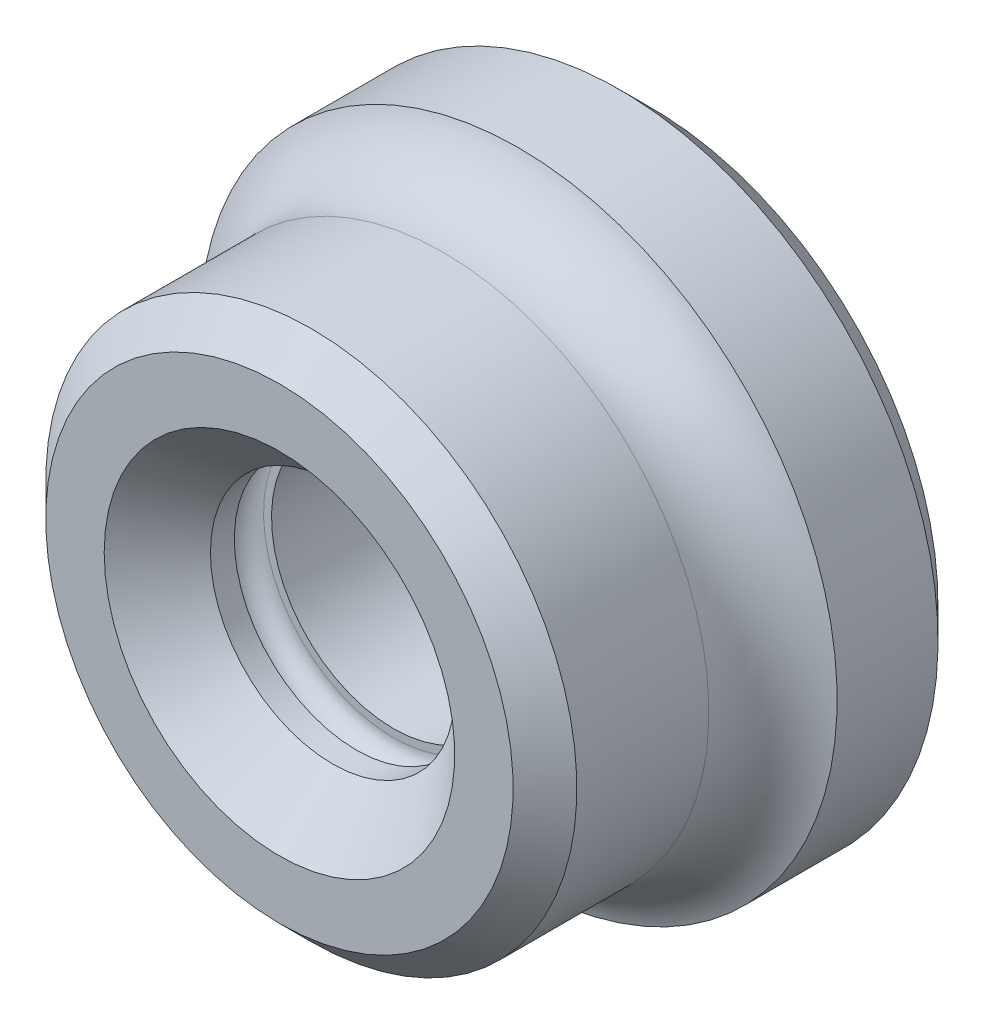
ISO-10303-21;
HEADER;
FILE_DESCRIPTION(('STEP AP214'),'2;1');
FILE_NAME('part.step','',(''),(''),'','','');
FILE_SCHEMA(('AUTOMOTIVE_DESIGN { 1 0 10303 214 1 1 1 1 }'));
ENDSEC;
DATA;
#1=APPLICATION_CONTEXT('core data for automotive mechanical design processes');
#2=APPLICATION_PROTOCOL_DEFINITION('international standard','automotive_design',2000,#1);
#3=PRODUCT_CONTEXT('',#1,'mechanical');
#4=PRODUCT('Part','Part','',(#3));
#5=PRODUCT_RELATED_PRODUCT_CATEGORY('part','',(#4));
#6=PRODUCT_DEFINITION_FORMATION('','',#4);
#7=PRODUCT_DEFINITION_CONTEXT('part definition',#1,'design');
#8=PRODUCT_DEFINITION('design','',#6,#7);
#9=PRODUCT_DEFINITION_SHAPE('','',#8);
#10=(LENGTH_UNIT() NAMED_UNIT(*) SI_UNIT(.MILLI.,.METRE.));
#11=(NAMED_UNIT(*) PLANE_ANGLE_UNIT() SI_UNIT($,.RADIAN.));
#12=(NAMED_UNIT(*) SI_UNIT($,.STERADIAN.) SOLID_ANGLE_UNIT());
#13=UNCERTAINTY_MEASURE_WITH_UNIT(LENGTH_MEASURE(1.E-05),#10,'distance_accuracy_value','');
#14=(GEOMETRIC_REPRESENTATION_CONTEXT(3) GLOBAL_UNCERTAINTY_ASSIGNED_CONTEXT((#13)) GLOBAL_UNIT_ASSIGNED_CONTEXT((#10,
#11,#12)) REPRESENTATION_CONTEXT('',''));
#15=CARTESIAN_POINT('',(0.,0.,0.));
#16=DIRECTION('',(0.,0.,1.));
#17=DIRECTION('',(1.,0.,0.));
#18=AXIS2_PLACEMENT_3D('',#15,#16,#17);
#19=CARTESIAN_POINT('',(0.,0.,2.99999999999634));
#20=DIRECTION('',(0.,0.,1.));
#21=DIRECTION('',(0.,-1.,0.));
#22=AXIS2_PLACEMENT_3D('',#19,#20,#21);
#23=CONICAL_SURFACE('',#22,2.30000000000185,1.0297442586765);
#24=CARTESIAN_POINT('',(0.,2.22044604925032E-13,1.61802057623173));
#25=VERTEX_POINT('',#24);
#26=VERTEX_LOOP('',#25);
#27=FACE_BOUND('',#26,.T.);
#28=CARTESIAN_POINT('',(0.,0.,3.));
#29=DIRECTION('',(0.,0.,1.));
#30=DIRECTION('',(0.,-1.,0.));
#31=AXIS2_PLACEMENT_3D('',#28,#29,#30);
#32=CIRCLE('',#31,2.3);
#33=CARTESIAN_POINT('',(0.,-2.3,3.));
#34=VERTEX_POINT('',#33);
#35=EDGE_CURVE('E30',#34,#34,#32,.T.);
#36=ORIENTED_EDGE('',*,*,#35,.T.);
#37=EDGE_LOOP('',(#36));
#38=FACE_BOUND('',#37,.T.);
#39=ADVANCED_FACE('F14',(#27,#38),#23,.F.);
#40=CARTESIAN_POINT('',(0.,0.,0.));
#41=DIRECTION('',(0.,0.,1.));
#42=DIRECTION('',(0.,-1.,0.));
#43=AXIS2_PLACEMENT_3D('',#40,#41,#42);
#44=CYLINDRICAL_SURFACE('',#43,2.3);
#45=ORIENTED_EDGE('',*,*,#35,.F.);
#46=EDGE_LOOP('',(#45));
#47=FACE_BOUND('',#46,.T.);
#48=CARTESIAN_POINT('',(0.,0.,4.85));
#49=DIRECTION('',(0.,0.,1.));
#50=DIRECTION('',(0.,-1.,0.));
#51=AXIS2_PLACEMENT_3D('',#48,#49,#50);
#52=CIRCLE('',#51,2.3);
#53=CARTESIAN_POINT('',(0.,-2.3,4.85));
#54=VERTEX_POINT('',#53);
#55=EDGE_CURVE('E17',#54,#54,#52,.T.);
#56=ORIENTED_EDGE('',*,*,#55,.T.);
#57=EDGE_LOOP('',(#56));
#58=FACE_BOUND('',#57,.T.);
#59=ADVANCED_FACE('F27',(#47,#58),#44,.F.);
#60=CARTESIAN_POINT('',(2.3,0.,4.85));
#61=DIRECTION('',(0.,0.,-1.));
#62=DIRECTION('',(0.,1.,0.));
#63=AXIS2_PLACEMENT_3D('',#60,#61,#62);
#64=PLANE('',#63);
#65=ORIENTED_EDGE('',*,*,#55,.F.);
#66=EDGE_LOOP('',(#65));
#67=FACE_BOUND('',#66,.T.);
#68=CARTESIAN_POINT('',(0.,0.,4.85));
#69=DIRECTION('',(0.,0.,-1.));
#70=DIRECTION('',(0.,1.,0.));
#71=AXIS2_PLACEMENT_3D('',#68,#69,#70);
#72=CIRCLE('',#71,2.45);
#73=CARTESIAN_POINT('',(0.,2.45,4.85));
#74=VERTEX_POINT('',#73);
#75=EDGE_CURVE('E34',#74,#74,#72,.F.);
#76=ORIENTED_EDGE('',*,*,#75,.T.);
#77=EDGE_LOOP('',(#76));
#78=FACE_BOUND('',#77,.T.);
#79=ADVANCED_FACE('F70',(#67,#78),#64,.F.);
#80=CARTESIAN_POINT('',(0.,0.,0.5));
#81=DIRECTION('',(0.,0.,-1.));
#82=DIRECTION('',(0.,1.,0.));
#83=AXIS2_PLACEMENT_3D('',#80,#81,#82);
#84=PLANE('',#83);
#85=CARTESIAN_POINT('',(0.,0.,0.5));
#86=DIRECTION('',(0.,0.,1.));
#87=DIRECTION('',(0.,-1.,0.));
#88=AXIS2_PLACEMENT_3D('',#85,#86,#87);
#89=CIRCLE('',#88,2.5);
#90=CARTESIAN_POINT('',(0.,-2.5,0.5));
#91=VERTEX_POINT('',#90);
#92=EDGE_CURVE('E61',#91,#91,#89,.F.);
#93=ORIENTED_EDGE('',*,*,#92,.T.);
#94=EDGE_LOOP('',(#93));
#95=FACE_BOUND('',#94,.T.);
#96=ADVANCED_FACE('F88',(#95),#84,.T.);
#97=CARTESIAN_POINT('',(0.,0.,5.2));
#98=DIRECTION('',(0.,0.,-1.));
#99=DIRECTION('',(0.,1.,0.));
#100=AXIS2_PLACEMENT_3D('',#97,#98,#99);
#101=TOROIDAL_SURFACE('',#100,2.45,0.35);
#102=ORIENTED_EDGE('',*,*,#75,.F.);
#103=EDGE_LOOP('',(#102));
#104=FACE_BOUND('',#103,.T.);
#105=CARTESIAN_POINT('',(0.,0.,5.55));
#106=DIRECTION('',(0.,0.,1.));
#107=DIRECTION('',(0.,1.,0.));
#108=AXIS2_PLACEMENT_3D('',#105,#106,#107);
#109=CIRCLE('',#108,2.45);
#110=CARTESIAN_POINT('',(0.,2.45,5.55));
#111=VERTEX_POINT('',#110);
#112=EDGE_CURVE('E60',#111,#111,#109,.T.);
#113=ORIENTED_EDGE('',*,*,#112,.T.);
#114=EDGE_LOOP('',(#113));
#115=FACE_BOUND('',#114,.T.);
#116=ADVANCED_FACE('F155',(#104,#115),#101,.F.);
#117=CARTESIAN_POINT('',(0.,0.,0.));
#118=DIRECTION('',(0.,0.,1.));
#119=DIRECTION('',(0.,-1.,0.));
#120=AXIS2_PLACEMENT_3D('',#117,#118,#119);
#121=CYLINDRICAL_SURFACE('',#120,2.5);
#122=ORIENTED_EDGE('',*,*,#92,.F.);
#123=EDGE_LOOP('',(#122));
#124=FACE_BOUND('',#123,.T.);
#125=CARTESIAN_POINT('',(0.,0.,0.));
#126=DIRECTION('',(0.,0.,1.));
#127=DIRECTION('',(0.,-1.,0.));
#128=AXIS2_PLACEMENT_3D('',#125,#126,#127);
#129=CIRCLE('',#128,2.5);
#130=CARTESIAN_POINT('',(0.,-2.5,0.));
#131=VERTEX_POINT('',#130);
#132=EDGE_CURVE('E58',#131,#131,#129,.F.);
#133=ORIENTED_EDGE('',*,*,#132,.T.);
#134=EDGE_LOOP('',(#133));
#135=FACE_BOUND('',#134,.T.);
#136=ADVANCED_FACE('F152',(#124,#135),#121,.F.);
#137=CARTESIAN_POINT('',(2.45,0.,5.55));
#138=DIRECTION('',(0.,0.,1.));
#139=DIRECTION('',(0.,-1.,0.));
#140=AXIS2_PLACEMENT_3D('',#137,#138,#139);
#141=PLANE('',#140);
#142=ORIENTED_EDGE('',*,*,#112,.F.);
#143=EDGE_LOOP('',(#142));
#144=FACE_BOUND('',#143,.T.);
#145=CARTESIAN_POINT('',(0.,0.,5.55));
#146=DIRECTION('',(0.,0.,1.));
#147=DIRECTION('',(0.,-1.,0.));
#148=AXIS2_PLACEMENT_3D('',#145,#146,#147);
#149=CIRCLE('',#148,2.3);
#150=CARTESIAN_POINT('',(0.,-2.3,5.55));
#151=VERTEX_POINT('',#150);
#152=EDGE_CURVE('E55',#151,#151,#149,.T.);
#153=ORIENTED_EDGE('',*,*,#152,.T.);
#154=EDGE_LOOP('',(#153));
#155=FACE_BOUND('',#154,.T.);
#156=ADVANCED_FACE('F141',(#144,#155),#141,.F.);
#157=CARTESIAN_POINT('',(5.4,0.,0.));
#158=DIRECTION('',(0.,0.,1.));
#159=DIRECTION('',(0.,-1.,0.));
#160=AXIS2_PLACEMENT_3D('',#157,#158,#159);
#161=PLANE('',#160);
#162=CARTESIAN_POINT('',(0.,0.,5.68433104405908E-11));
#163=DIRECTION('',(0.,0.,1.));
#164=DIRECTION('',(0.,-1.,0.));
#165=AXIS2_PLACEMENT_3D('',#162,#163,#164);
#166=CIRCLE('',#165,5.39999999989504);
#167=CARTESIAN_POINT('',(0.,-5.39999999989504,5.68433104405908E-11));
#168=VERTEX_POINT('',#167);
#169=EDGE_CURVE('E51',#168,#168,#166,.T.);
#170=ORIENTED_EDGE('',*,*,#169,.F.);
#171=EDGE_LOOP('',(#170));
#172=FACE_BOUND('',#171,.T.);
#173=ORIENTED_EDGE('',*,*,#132,.F.);
#174=EDGE_LOOP('',(#173));
#175=FACE_BOUND('',#174,.T.);
#176=ADVANCED_FACE('F151',(#172,#175),#161,.F.);
#177=CARTESIAN_POINT('',(0.,0.,0.));
#178=DIRECTION('',(0.,0.,1.));
#179=DIRECTION('',(0.,-1.,0.));
#180=AXIS2_PLACEMENT_3D('',#177,#178,#179);
#181=CYLINDRICAL_SURFACE('',#180,2.3);
#182=ORIENTED_EDGE('',*,*,#152,.F.);
#183=EDGE_LOOP('',(#182));
#184=FACE_BOUND('',#183,.T.);
#185=CARTESIAN_POINT('',(0.,0.,6.00000000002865));
#186=DIRECTION('',(0.,0.,1.));
#187=DIRECTION('',(0.,-1.,0.));
#188=AXIS2_PLACEMENT_3D('',#185,#186,#187);
#189=CIRCLE('',#188,2.29999999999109);
#190=CARTESIAN_POINT('',(0.,-2.29999999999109,6.00000000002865));
#191=VERTEX_POINT('',#190);
#192=EDGE_CURVE('E54',#191,#191,#189,.T.);
#193=ORIENTED_EDGE('',*,*,#192,.T.);
#194=EDGE_LOOP('',(#193));
#195=FACE_BOUND('',#194,.T.);
#196=ADVANCED_FACE('F228',(#184,#195),#181,.F.);
#197=CARTESIAN_POINT('',(0.,0.,0.599999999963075));
#198=DIRECTION('',(0.,0.,1.));
#199=DIRECTION('',(0.,-1.,0.));
#200=AXIS2_PLACEMENT_3D('',#197,#198,#199);
#201=CONICAL_SURFACE('',#200,5.99999999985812,0.785398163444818);
#202=CARTESIAN_POINT('',(0.,0.,0.6));
#203=DIRECTION('',(0.,0.,1.));
#204=DIRECTION('',(0.,-1.,0.));
#205=AXIS2_PLACEMENT_3D('',#202,#203,#204);
#206=CIRCLE('',#205,6.);
#207=CARTESIAN_POINT('',(0.,-6.,0.6));
#208=VERTEX_POINT('',#207);
#209=EDGE_CURVE('E50',#208,#208,#206,.T.);
#210=ORIENTED_EDGE('',*,*,#209,.F.);
#211=EDGE_LOOP('',(#210));
#212=FACE_BOUND('',#211,.T.);
#213=ORIENTED_EDGE('',*,*,#169,.T.);
#214=EDGE_LOOP('',(#213));
#215=FACE_BOUND('',#214,.T.);
#216=ADVANCED_FACE('F235',(#212,#215),#201,.T.);
#217=CARTESIAN_POINT('',(0.,0.,6.99999999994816));
#218=DIRECTION('',(0.,0.,1.));
#219=DIRECTION('',(-1.,0.,0.));
#220=AXIS2_PLACEMENT_3D('',#217,#218,#219);
#221=CONICAL_SURFACE('',#220,3.29999999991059,0.785398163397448);
#222=ORIENTED_EDGE('',*,*,#192,.F.);
#223=EDGE_LOOP('',(#222));
#224=FACE_BOUND('',#223,.T.);
#225=CARTESIAN_POINT('',(0.,0.,7.000000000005));
#226=DIRECTION('',(0.,0.,1.));
#227=DIRECTION('',(-1.,0.,0.));
#228=AXIS2_PLACEMENT_3D('',#225,#226,#227);
#229=CIRCLE('',#228,3.29999999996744);
#230=CARTESIAN_POINT('',(-3.29999999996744,0.,7.000000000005));
#231=VERTEX_POINT('',#230);
#232=EDGE_CURVE('E47',#231,#231,#229,.T.);
#233=ORIENTED_EDGE('',*,*,#232,.T.);
#234=EDGE_LOOP('',(#233));
#235=FACE_BOUND('',#234,.T.);
#236=ADVANCED_FACE('F243',(#224,#235),#221,.F.);
#237=CARTESIAN_POINT('',(0.,0.,0.));
#238=DIRECTION('',(0.,0.,1.));
#239=DIRECTION('',(0.,-1.,0.));
#240=AXIS2_PLACEMENT_3D('',#237,#238,#239);
#241=CYLINDRICAL_SURFACE('',#240,6.);
#242=CARTESIAN_POINT('',(0.,0.,2.5));
#243=DIRECTION('',(0.,0.,-1.));
#244=DIRECTION('',(0.,1.,0.));
#245=AXIS2_PLACEMENT_3D('',#242,#243,#244);
#246=CIRCLE('',#245,6.);
#247=CARTESIAN_POINT('',(0.,6.,2.5));
#248=VERTEX_POINT('',#247);
#249=EDGE_CURVE('E46',#248,#248,#246,.T.);
#250=ORIENTED_EDGE('',*,*,#249,.T.);
#251=EDGE_LOOP('',(#250));
#252=FACE_BOUND('',#251,.T.);
#253=ORIENTED_EDGE('',*,*,#209,.T.);
#254=EDGE_LOOP('',(#253));
#255=FACE_BOUND('',#254,.T.);
#256=ADVANCED_FACE('F252',(#252,#255),#241,.T.);
#257=CARTESIAN_POINT('',(3.3,0.,7.));
#258=DIRECTION('',(0.,0.,-1.));
#259=DIRECTION('',(0.,1.,0.));
#260=AXIS2_PLACEMENT_3D('',#257,#258,#259);
#261=PLANE('',#260);
#262=ORIENTED_EDGE('',*,*,#232,.F.);
#263=EDGE_LOOP('',(#262));
#264=FACE_BOUND('',#263,.T.);
#265=CARTESIAN_POINT('',(0.,0.,7.000000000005));
#266=DIRECTION('',(0.,0.,-1.));
#267=DIRECTION('',(0.,1.,0.));
#268=AXIS2_PLACEMENT_3D('',#265,#266,#267);
#269=CIRCLE('',#268,4.39999999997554);
#270=CARTESIAN_POINT('',(0.,4.39999999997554,7.000000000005));
#271=VERTEX_POINT('',#270);
#272=EDGE_CURVE('E43',#271,#271,#269,.T.);
#273=ORIENTED_EDGE('',*,*,#272,.F.);
#274=EDGE_LOOP('',(#273));
#275=FACE_BOUND('',#274,.T.);
#276=ADVANCED_FACE('F113',(#264,#275),#261,.F.);
#277=CARTESIAN_POINT('',(0.,0.,3.91421356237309));
#278=DIRECTION('',(0.,0.,-1.));
#279=DIRECTION('',(0.,1.,0.));
#280=AXIS2_PLACEMENT_3D('',#277,#278,#279);
#281=TOROIDAL_SURFACE('',#280,6.5,1.5);
#282=CARTESIAN_POINT('',(0.,0.,3.91421356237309));
#283=DIRECTION('',(0.,0.,1.));
#284=DIRECTION('',(0.,-1.,0.));
#285=AXIS2_PLACEMENT_3D('',#282,#283,#284);
#286=CIRCLE('',#285,5.);
#287=CARTESIAN_POINT('',(0.,-5.,3.91421356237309));
#288=VERTEX_POINT('',#287);
#289=EDGE_CURVE('E21',#288,#288,#286,.T.);
#290=ORIENTED_EDGE('',*,*,#289,.F.);
#291=EDGE_LOOP('',(#290));
#292=FACE_BOUND('',#291,.T.);
#293=ORIENTED_EDGE('',*,*,#249,.F.);
#294=EDGE_LOOP('',(#293));
#295=FACE_BOUND('',#294,.T.);
#296=ADVANCED_FACE('F105',(#292,#295),#281,.F.);
#297=CARTESIAN_POINT('',(0.,0.,6.39999999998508));
#298=DIRECTION('',(0.,0.,-1.));
#299=DIRECTION('',(0.,1.,0.));
#300=AXIS2_PLACEMENT_3D('',#297,#298,#299);
#301=CONICAL_SURFACE('',#300,4.99999999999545,0.785398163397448);
#302=ORIENTED_EDGE('',*,*,#272,.T.);
#303=EDGE_LOOP('',(#302));
#304=FACE_BOUND('',#303,.T.);
#305=CARTESIAN_POINT('',(0.,0.,6.4));
#306=DIRECTION('',(0.,0.,1.));
#307=DIRECTION('',(0.,-1.,0.));
#308=AXIS2_PLACEMENT_3D('',#305,#306,#307);
#309=CIRCLE('',#308,5.);
#310=CARTESIAN_POINT('',(0.,-5.,6.4));
#311=VERTEX_POINT('',#310);
#312=EDGE_CURVE('E9',#311,#311,#309,.F.);
#313=ORIENTED_EDGE('',*,*,#312,.F.);
#314=EDGE_LOOP('',(#313));
#315=FACE_BOUND('',#314,.T.);
#316=ADVANCED_FACE('F98',(#304,#315),#301,.T.);
#317=CARTESIAN_POINT('',(0.,0.,0.));
#318=DIRECTION('',(0.,0.,1.));
#319=DIRECTION('',(0.,-1.,0.));
#320=AXIS2_PLACEMENT_3D('',#317,#318,#319);
#321=CYLINDRICAL_SURFACE('',#320,5.);
#322=ORIENTED_EDGE('',*,*,#312,.T.);
#323=EDGE_LOOP('',(#322));
#324=FACE_BOUND('',#323,.T.);
#325=ORIENTED_EDGE('',*,*,#289,.T.);
#326=EDGE_LOOP('',(#325));
#327=FACE_BOUND('',#326,.T.);
#328=ADVANCED_FACE('F96',(#324,#327),#321,.T.);
#329=CLOSED_SHELL('',(#39,#59,#79,#96,#116,#136,#156,#176,#196,#216,#236,#256,#276,#296,#316,#328));
#330=MANIFOLD_SOLID_BREP('B1',#329);
#331=ADVANCED_BREP_SHAPE_REPRESENTATION('',(#18,#330),#14);
#332=SHAPE_DEFINITION_REPRESENTATION(#9,#331);
ENDSEC;
END-ISO-10303-21;
